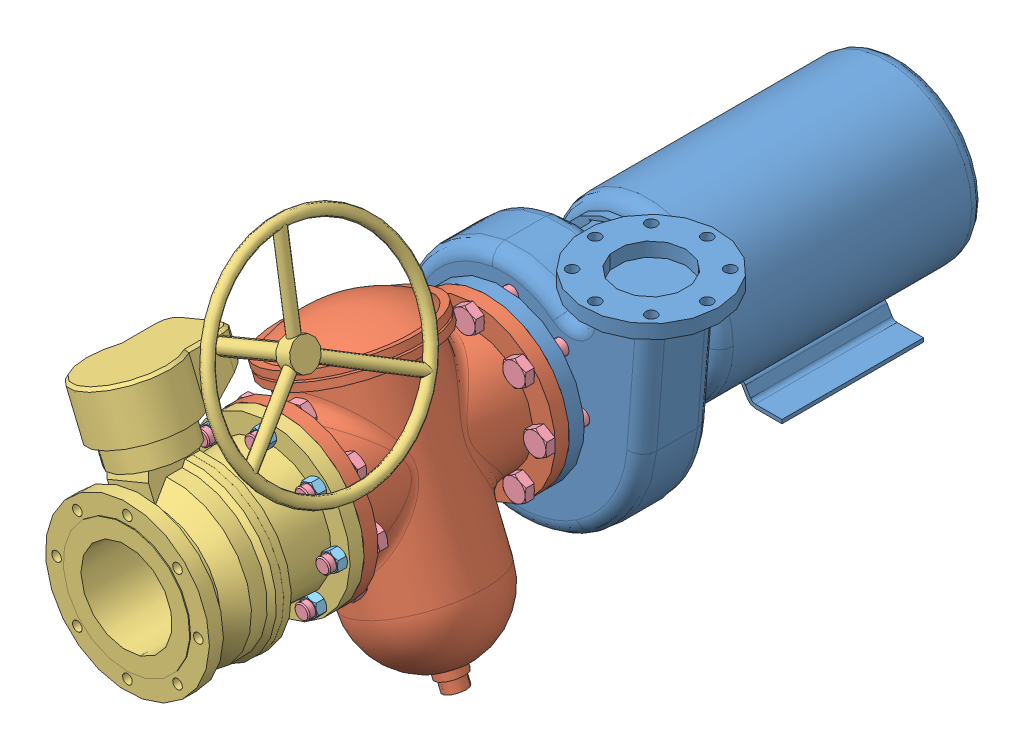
SolidWorks assembly Pump_Strainer_Valve.SLDASM, configuration Default (file format 13000). Lengths in mm.
Overall size (587.63 844.65 1319.21).
27 component instances, 5 part files, 27 mates.
Components (placement in the parent):
- PUMP-1: PUMP.SLDPRT [Default] at origin size (506.42 481.34 717.55)
- strainer-1: strainer.sldprt [Default] at (0 0 276.225) x (0 0 -1) z (0.92388 0.382683 0) size (352.43 514.41 279.4)
- Valve_w_handwheel-1: Valve_w_handwheel.sldprt [Default] at (0 0 715.9625) x (0 0 -1) z (0.92388 0.382683 0) size (387.36 574.68 390.53)
- Hex Finished Bolt_AI-1: Hex Finished Bolt_AI.SLDPRT [PreviewCfg] at (85.3124 85.3124 411.1117) x (0 0 1) z (-1 0 0) size (92.13 43.99 38.1)
- Hex Nut_AI-1: Hex Nut_AI.sldprt [PreviewCfg] at (85.3124 85.3124 474.6625) x (-0.673646 -0.739054 0) z (0 0 -1) size (28.57 33 16.89)
- Hex Finished Bolt_AI-3: Hex Finished Bolt_AI.SLDPRT [PreviewCfg] at (120.65 0 411.1117) x (0 0 1) z (-0.707107 0.707107 0) size (92.13 43.99 38.1)
- Hex Finished Bolt_AI-4: Hex Finished Bolt_AI.SLDPRT [PreviewCfg] at (85.3124 -85.3124 411.1117) x (0 0 1) z (0 1 0) size (92.13 43.99 38.1)
- Hex Finished Bolt_AI-5: Hex Finished Bolt_AI.SLDPRT [PreviewCfg] at (0 -120.65 411.1117) x (0 0 1) z (0.707107 0.707107 0) size (92.13 43.99 38.1)
- Hex Finished Bolt_AI-6: Hex Finished Bolt_AI.SLDPRT [PreviewCfg] at (-85.3124 -85.3124 411.1117) x (0 0 1) z (1 0 0) size (92.13 43.99 38.1)
- Hex Finished Bolt_AI-7: Hex Finished Bolt_AI.SLDPRT [PreviewCfg] at (-120.65 0 411.1117) x (0 0 1) z (0.707107 -0.707107 0) size (92.13 43.99 38.1)
- Hex Finished Bolt_AI-8: Hex Finished Bolt_AI.SLDPRT [PreviewCfg] at (-85.3124 85.3124 411.1117) x (0 0 1) z (0 -1 0) size (92.13 43.99 38.1)
- Hex Finished Bolt_AI-9: Hex Finished Bolt_AI.SLDPRT [PreviewCfg] at (0 120.65 411.1117) x (0 0 1) z (-0.707107 -0.707107 0) size (92.13 43.99 38.1)
- Hex Nut_AI-2: Hex Nut_AI.sldprt [PreviewCfg] at (120.65 0 474.6625) x (-0.99893 -0.04625 0) z (0 0 -1) size (28.57 33 16.89)
- Hex Nut_AI-3: Hex Nut_AI.sldprt [PreviewCfg] at (85.3124 -85.3124 474.6625) x (-0.739054 0.673646 0) z (0 0 -1) size (28.57 33 16.89)
- Hex Nut_AI-4: Hex Nut_AI.sldprt [PreviewCfg] at (0 -120.65 474.6625) x (-0.04625 0.99893 0) z (0 0 -1) size (28.57 33 16.89)
- Hex Nut_AI-5: Hex Nut_AI.sldprt [PreviewCfg] at (-85.3124 -85.3124 474.6625) x (0.673646 0.739054 0) z (0 0 -1) size (28.57 33 16.89)
- Hex Nut_AI-6: Hex Nut_AI.sldprt [PreviewCfg] at (-120.65 0 474.6625) x (0.99893 0.04625 0) z (0 0 -1) size (28.57 33 16.89)
- Hex Nut_AI-7: Hex Nut_AI.sldprt [PreviewCfg] at (-85.3124 85.3124 474.6625) x (0.739054 -0.673646 0) z (0 0 -1) size (28.57 33 16.89)
- Hex Nut_AI-8: Hex Nut_AI.sldprt [PreviewCfg] at (0 120.65 474.6625) x (0.04625 -0.99893 0) z (0 0 -1) size (28.57 33 16.89)
- Hex Finished Bolt_AI-10: Hex Finished Bolt_AI.SLDPRT [PreviewCfg] at (85.3124 85.3124 141.3383) x (0 0 -1) z (1 0 0) size (92.13 43.99 38.1)
- Hex Finished Bolt_AI-12: Hex Finished Bolt_AI.SLDPRT [PreviewCfg] at (0 120.65 141.3383) x (0 0 -1) z (1 0 0) size (92.13 43.99 38.1)
- Hex Finished Bolt_AI-13: Hex Finished Bolt_AI.SLDPRT [PreviewCfg] at (120.65 0 141.3383) x (0 0 -1) z (1 0 0) size (92.13 43.99 38.1)
- Hex Finished Bolt_AI-14: Hex Finished Bolt_AI.SLDPRT [PreviewCfg] at (85.3124 -85.3124 141.3383) x (0 0 -1) z (1 0 0) size (92.13 43.99 38.1)
- Hex Finished Bolt_AI-15: Hex Finished Bolt_AI.SLDPRT [PreviewCfg] at (-85.3124 85.3124 141.3383) x (0 0 -1) z (1 0 0) size (92.13 43.99 38.1)
- Hex Finished Bolt_AI-16: Hex Finished Bolt_AI.SLDPRT [PreviewCfg] at (-120.65 0 141.3383) x (0 0 -1) z (1 0 0) size (92.13 43.99 38.1)
- Hex Finished Bolt_AI-17: Hex Finished Bolt_AI.SLDPRT [PreviewCfg] at (-85.3124 -85.3124 141.3383) x (0 0 -1) z (1 0 0) size (92.13 43.99 38.1)
- Hex Finished Bolt_AI-18: Hex Finished Bolt_AI.SLDPRT [PreviewCfg] at (0 -120.65 141.3383) x (0 0 -1) z (1 0 0) size (92.13 43.99 38.1)
Mates (geometry in assembly coordinates):
- Concentric1: concentric anti-aligned: cylinder of PUMP-1 through (0 0 -181.0643) axis (0 0 1) radius 85.344; cylinder of strainer-1 through (0 0 215.7206) axis (0 0 -1) radius 77.089
- Coincident1: coincident anti-aligned: plane of PUMP-1 through (0 0 101.6) normal (0 0 1); plane of strainer-1 through (0 0 101.6) normal (0 0 -1)
- Concentric3: concentric anti-aligned: cylinder of PUMP-1 through (85.3124 85.3124 76.2) axis (0 0 1) radius 11.176; cylinder of strainer-1 through (85.3124 85.3124 101.6) axis (0 0 -1) radius 9.9212
- Concentric4: concentric aligned: cylinder of Valve_w_handwheel-1 through (0 0 715.9625) axis (0 0 -1) radius 77.7875; cylinder of strainer-1 through (0 0 452.4375) axis (0 0 -1) radius 77.089
- Concentric5: concentric anti-aligned: cylinder of strainer-1 through (85.3124 85.3124 450.85) axis (0 0 1) radius 9.9212; cylinder of Valve_w_handwheel-1 through (85.3124 85.3124 450.85) axis (0 0 -1) radius 8.3337
- Coincident3: coincident anti-aligned: plane of strainer-1 through (0 0 450.85) normal (0 0 1); plane of Valve_w_handwheel-1 through (0 0 450.85) normal (0 0 -1)
- Concentric7: concentric anti-aligned: cylinder of strainer-1 through (85.3124 85.3124 450.85) axis (0 0 1) radius 9.9212; cylinder of Hex Finished Bolt_AI-1 through (85.3124 85.3124 411.1117) axis (0 0 -1) radius 12.7
- Coincident4: coincident anti-aligned: plane of strainer-1 through (0 0 427.0375) normal (0 0 -1); plane of Hex Finished Bolt_AI-1 through (85.3124 107.3095 427.0375) normal (0 0 1)
- Concentric12: concentric aligned: cylinder of Hex Finished Bolt_AI-1 through (85.3124 85.3124 411.1117) axis (0 0 -1) radius 12.7; cylinder of Hex Nut_AI-1 through (85.3124 85.3124 499.7) axis (0 0 -1) radius 9.525
- Concentric111: concentric aligned: cylinder of Hex Finished Bolt_AI-1 through (85.3124 85.3124 411.1117) axis (0 0 -1) radius 12.7; cylinder of Hex Nut_AI-1 through (85.3124 85.3124 499.7) axis (0 0 -1) radius 9.525
- Coincident7: coincident anti-aligned: plane of Valve_w_handwheel-1 through (0 0 474.6625) normal (0 0 1); plane of Hex Nut_AI-1 through (73.1197 96.4261 474.6625) normal (0 0 -1)
- Concentric13: concentric anti-aligned: cylinder of strainer-1 through (85.3124 85.3124 101.6) axis (0 0 -1) radius 9.9212; cylinder of Hex Finished Bolt_AI-10 through (85.3124 85.3124 141.3383) axis (0 0 1) radius 12.7
- Coincident8: coincident anti-aligned: plane of strainer-1 through (0 0 125.4125) normal (0 0 1); plane of Hex Finished Bolt_AI-10 through (85.3124 107.3095 125.4125) normal (0 0 -1)
- Concentric15: concentric anti-aligned: cylinder of strainer-1 through (0 120.65 101.6) axis (0 0 -1) radius 9.9212; cylinder of Hex Finished Bolt_AI-12 through (0 120.65 141.3383) axis (0 0 1) radius 12.7
- Coincident10: coincident anti-aligned: plane of strainer-1 through (0 0 125.4125) normal (0 0 1); plane of Hex Finished Bolt_AI-12 through (0 142.647 125.4125) normal (0 0 -1)
- Concentric16: concentric anti-aligned: cylinder of strainer-1 through (120.65 0 101.6) axis (0 0 -1) radius 9.9212; cylinder of Hex Finished Bolt_AI-13 through (120.65 0 141.3383) axis (0 0 1) radius 19.05
- Coincident11: coincident anti-aligned: plane of strainer-1 through (0 0 125.4125) normal (0 0 1); plane of Hex Finished Bolt_AI-13 through (120.65 21.997 125.4125) normal (0 0 -1)
- Concentric17: concentric anti-aligned: cylinder of strainer-1 through (85.3124 -85.3124 101.6) axis (0 0 -1) radius 9.9212; cylinder of Hex Finished Bolt_AI-14 through (85.3124 -85.3124 141.3383) axis (0 0 1) radius 19.05
- Coincident12: coincident anti-aligned: plane of strainer-1 through (0 0 125.4125) normal (0 0 1); plane of Hex Finished Bolt_AI-14 through (85.3124 -63.3154 125.4125) normal (0 0 -1)
- Concentric18: concentric anti-aligned: cylinder of strainer-1 through (-85.3124 85.3124 101.6) axis (0 0 -1) radius 9.9212; cylinder of Hex Finished Bolt_AI-15 through (-85.3124 85.3124 141.3383) axis (0 0 1) radius 19.05
- Coincident13: coincident anti-aligned: plane of strainer-1 through (0 0 125.4125) normal (0 0 1); plane of Hex Finished Bolt_AI-15 through (-85.3124 107.3095 125.4125) normal (0 0 -1)
- Concentric19: concentric anti-aligned: cylinder of strainer-1 through (-120.65 0 101.6) axis (0 0 -1) radius 9.9212; cylinder of Hex Finished Bolt_AI-16 through (-120.65 0 141.3383) axis (0 0 1) radius 19.05
- Coincident14: coincident anti-aligned: plane of strainer-1 through (0 0 125.4125) normal (0 0 1); plane of Hex Finished Bolt_AI-16 through (-120.65 21.997 125.4125) normal (0 0 -1)
- Concentric20: concentric anti-aligned: cylinder of strainer-1 through (-85.3124 -85.3124 101.6) axis (0 0 -1) radius 9.9212; cylinder of Hex Finished Bolt_AI-17 through (-85.3124 -85.3124 141.3383) axis (0 0 1) radius 19.05
- Coincident15: coincident anti-aligned: plane of strainer-1 through (0 0 125.4125) normal (0 0 1); plane of Hex Finished Bolt_AI-17 through (-85.3124 -63.3154 125.4125) normal (0 0 -1)
- Concentric21: concentric anti-aligned: cylinder of strainer-1 through (0 -120.65 101.6) axis (0 0 -1) radius 9.9212; cylinder of Hex Finished Bolt_AI-18 through (0 -120.65 141.3383) axis (0 0 1) radius 19.05
- Coincident16: coincident anti-aligned: plane of strainer-1 through (0 0 125.4125) normal (0 0 1); plane of Hex Finished Bolt_AI-18 through (0 -98.653 125.4125) normal (0 0 -1)
